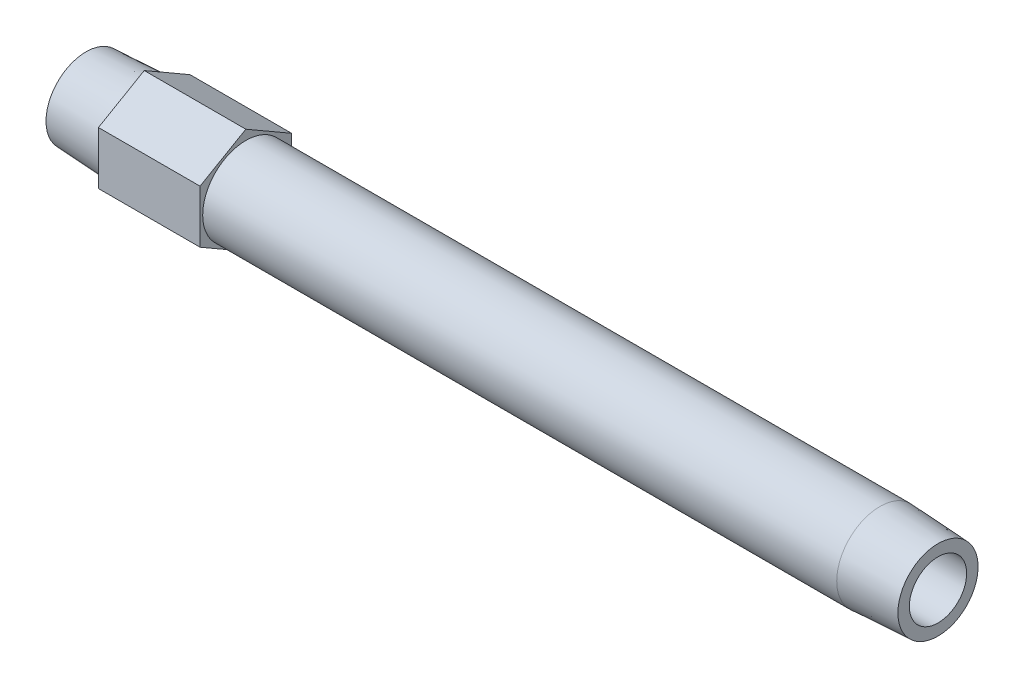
ISO-10303-21;
HEADER;
FILE_DESCRIPTION(('STEP AP214'),'2;1');
FILE_NAME('part.step','',(''),(''),'','','');
FILE_SCHEMA(('AUTOMOTIVE_DESIGN { 1 0 10303 214 1 1 1 1 }'));
ENDSEC;
DATA;
#1=APPLICATION_CONTEXT('core data for automotive mechanical design processes');
#2=APPLICATION_PROTOCOL_DEFINITION('international standard','automotive_design',2000,#1);
#3=PRODUCT_CONTEXT('',#1,'mechanical');
#4=PRODUCT('Part','Part','',(#3));
#5=PRODUCT_RELATED_PRODUCT_CATEGORY('part','',(#4));
#6=PRODUCT_DEFINITION_FORMATION('','',#4);
#7=PRODUCT_DEFINITION_CONTEXT('part definition',#1,'design');
#8=PRODUCT_DEFINITION('design','',#6,#7);
#9=PRODUCT_DEFINITION_SHAPE('','',#8);
#10=(LENGTH_UNIT() NAMED_UNIT(*) SI_UNIT(.MILLI.,.METRE.));
#11=(NAMED_UNIT(*) PLANE_ANGLE_UNIT() SI_UNIT($,.RADIAN.));
#12=(NAMED_UNIT(*) SI_UNIT($,.STERADIAN.) SOLID_ANGLE_UNIT());
#13=UNCERTAINTY_MEASURE_WITH_UNIT(LENGTH_MEASURE(1.E-05),#10,'distance_accuracy_value','');
#14=(GEOMETRIC_REPRESENTATION_CONTEXT(3) GLOBAL_UNCERTAINTY_ASSIGNED_CONTEXT((#13)) GLOBAL_UNIT_ASSIGNED_CONTEXT((#10,
#11,#12)) REPRESENTATION_CONTEXT('',''));
#15=CARTESIAN_POINT('',(0.,0.,0.));
#16=DIRECTION('',(0.,0.,1.));
#17=DIRECTION('',(1.,0.,0.));
#18=AXIS2_PLACEMENT_3D('',#15,#16,#17);
#19=CARTESIAN_POINT('',(0.,0.,-4.78009397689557));
#20=DIRECTION('',(1.,0.,0.));
#21=DIRECTION('',(0.,0.,-1.));
#22=AXIS2_PLACEMENT_3D('',#19,#20,#21);
#23=PLANE('',#22);
#24=CARTESIAN_POINT('',(0.,0.,0.));
#25=DIRECTION('',(-1.,0.,0.));
#26=DIRECTION('',(0.,0.,1.));
#27=AXIS2_PLACEMENT_3D('',#24,#25,#26);
#28=CIRCLE('',#27,4.78009397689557);
#29=CARTESIAN_POINT('',(0.,0.,4.78009397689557));
#30=VERTEX_POINT('',#29);
#31=EDGE_CURVE('E147',#30,#30,#28,.T.);
#32=ORIENTED_EDGE('',*,*,#31,.T.);
#33=EDGE_LOOP('',(#32));
#34=FACE_BOUND('',#33,.T.);
#35=CARTESIAN_POINT('',(0.,0.,0.));
#36=DIRECTION('',(1.,0.,0.));
#37=DIRECTION('',(0.,0.,1.));
#38=AXIS2_PLACEMENT_3D('',#35,#36,#37);
#39=CIRCLE('',#38,3.4163);
#40=CARTESIAN_POINT('',(0.,0.,3.4163));
#41=VERTEX_POINT('',#40);
#42=EDGE_CURVE('E159',#41,#41,#39,.T.);
#43=ORIENTED_EDGE('',*,*,#42,.T.);
#44=EDGE_LOOP('',(#43));
#45=FACE_BOUND('',#44,.T.);
#46=ADVANCED_FACE('F15',(#34,#45),#23,.F.);
#47=CARTESIAN_POINT('',(101.6,0.,-4.78009397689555));
#48=DIRECTION('',(-1.,0.,0.));
#49=DIRECTION('',(0.,0.,1.));
#50=AXIS2_PLACEMENT_3D('',#47,#48,#49);
#51=PLANE('',#50);
#52=CARTESIAN_POINT('',(101.6,0.,0.));
#53=DIRECTION('',(-1.,0.,0.));
#54=DIRECTION('',(0.,0.,1.));
#55=AXIS2_PLACEMENT_3D('',#52,#53,#54);
#56=CIRCLE('',#55,4.78009397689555);
#57=CARTESIAN_POINT('',(101.6,0.,4.78009397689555));
#58=VERTEX_POINT('',#57);
#59=EDGE_CURVE('E150',#58,#58,#56,.T.);
#60=ORIENTED_EDGE('',*,*,#59,.F.);
#61=EDGE_LOOP('',(#60));
#62=FACE_BOUND('',#61,.T.);
#63=CARTESIAN_POINT('',(101.6,0.,0.));
#64=DIRECTION('',(-1.,0.,0.));
#65=DIRECTION('',(0.,0.,1.));
#66=AXIS2_PLACEMENT_3D('',#63,#64,#65);
#67=CIRCLE('',#66,3.4163);
#68=CARTESIAN_POINT('',(101.6,0.,3.4163));
#69=VERTEX_POINT('',#68);
#70=EDGE_CURVE('E156',#69,#69,#67,.F.);
#71=ORIENTED_EDGE('',*,*,#70,.F.);
#72=EDGE_LOOP('',(#71));
#73=FACE_BOUND('',#72,.T.);
#74=ADVANCED_FACE('F178',(#62,#73),#51,.F.);
#75=CARTESIAN_POINT('',(19.05,-9.45872946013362,5.461));
#76=DIRECTION('',(-1.,0.,0.));
#77=DIRECTION('',(0.,-1.,0.));
#78=AXIS2_PLACEMENT_3D('',#75,#76,#77);
#79=PLANE('',#78);
#80=DIRECTION('',(0.,0.5,-0.866025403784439));
#81=VECTOR('',#80,1.);
#82=CARTESIAN_POINT('',(19.05,-6.30581964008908,0.));
#83=LINE('',#82,#81);
#84=CARTESIAN_POINT('',(19.05,-6.30581964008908,0.));
#85=VERTEX_POINT('',#84);
#86=CARTESIAN_POINT('',(19.05,-3.15290982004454,-5.461));
#87=VERTEX_POINT('',#86);
#88=EDGE_CURVE('E103',#85,#87,#83,.T.);
#89=ORIENTED_EDGE('',*,*,#88,.T.);
#90=DIRECTION('',(0.,1.,0.));
#91=VECTOR('',#90,1.);
#92=CARTESIAN_POINT('',(19.05,-3.15290982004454,-5.461));
#93=LINE('',#92,#91);
#94=CARTESIAN_POINT('',(19.05,3.15290982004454,-5.461));
#95=VERTEX_POINT('',#94);
#96=EDGE_CURVE('E83',#87,#95,#93,.T.);
#97=ORIENTED_EDGE('',*,*,#96,.T.);
#98=DIRECTION('',(0.,0.5,0.866025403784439));
#99=VECTOR('',#98,1.);
#100=CARTESIAN_POINT('',(19.05,3.15290982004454,-5.461));
#101=LINE('',#100,#99);
#102=CARTESIAN_POINT('',(19.05,6.30581964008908,0.));
#103=VERTEX_POINT('',#102);
#104=EDGE_CURVE('E102',#95,#103,#101,.T.);
#105=ORIENTED_EDGE('',*,*,#104,.T.);
#106=DIRECTION('',(0.,-0.5,0.866025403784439));
#107=VECTOR('',#106,1.);
#108=CARTESIAN_POINT('',(19.05,6.30581964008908,0.));
#109=LINE('',#108,#107);
#110=CARTESIAN_POINT('',(19.05,3.15290982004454,5.461));
#111=VERTEX_POINT('',#110);
#112=EDGE_CURVE('E105',#103,#111,#109,.T.);
#113=ORIENTED_EDGE('',*,*,#112,.T.);
#114=DIRECTION('',(0.,-1.,0.));
#115=VECTOR('',#114,1.);
#116=CARTESIAN_POINT('',(19.05,3.15290982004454,5.461));
#117=LINE('',#116,#115);
#118=CARTESIAN_POINT('',(19.05,-3.15290982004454,5.461));
#119=VERTEX_POINT('',#118);
#120=EDGE_CURVE('E35',#111,#119,#117,.T.);
#121=ORIENTED_EDGE('',*,*,#120,.T.);
#122=DIRECTION('',(0.,-0.5,-0.866025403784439));
#123=VECTOR('',#122,1.);
#124=CARTESIAN_POINT('',(19.05,-3.15290982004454,5.461));
#125=LINE('',#124,#123);
#126=EDGE_CURVE('E30',#119,#85,#125,.T.);
#127=ORIENTED_EDGE('',*,*,#126,.T.);
#128=EDGE_LOOP('',(#89,#97,#105,#113,#121,#127));
#129=FACE_BOUND('',#128,.T.);
#130=CARTESIAN_POINT('',(19.05,0.,0.));
#131=DIRECTION('',(-1.,0.,0.));
#132=DIRECTION('',(0.,-1.,0.));
#133=AXIS2_PLACEMENT_3D('',#130,#131,#132);
#134=CIRCLE('',#133,5.1435);
#135=CARTESIAN_POINT('',(19.05,-5.1435,0.));
#136=VERTEX_POINT('',#135);
#137=EDGE_CURVE('E89',#136,#136,#134,.F.);
#138=ORIENTED_EDGE('',*,*,#137,.F.);
#139=EDGE_LOOP('',(#138));
#140=FACE_BOUND('',#139,.T.);
#141=ADVANCED_FACE('F124',(#129,#140),#79,.F.);
#142=CARTESIAN_POINT('',(6.9342,-9.45872946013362,5.461));
#143=DIRECTION('',(-1.,0.,0.));
#144=DIRECTION('',(0.,-1.,0.));
#145=AXIS2_PLACEMENT_3D('',#142,#143,#144);
#146=PLANE('',#145);
#147=DIRECTION('',(0.,0.5,-0.866025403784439));
#148=VECTOR('',#147,1.);
#149=CARTESIAN_POINT('',(6.9342,-6.30581964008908,0.));
#150=LINE('',#149,#148);
#151=CARTESIAN_POINT('',(6.9342,-6.30581964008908,0.));
#152=VERTEX_POINT('',#151);
#153=CARTESIAN_POINT('',(6.9342,-3.15290982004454,-5.461));
#154=VERTEX_POINT('',#153);
#155=EDGE_CURVE('E73',#152,#154,#150,.T.);
#156=ORIENTED_EDGE('',*,*,#155,.F.);
#157=DIRECTION('',(0.,-0.5,-0.866025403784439));
#158=VECTOR('',#157,1.);
#159=CARTESIAN_POINT('',(6.9342,-3.15290982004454,5.461));
#160=LINE('',#159,#158);
#161=CARTESIAN_POINT('',(6.9342,-3.15290982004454,5.461));
#162=VERTEX_POINT('',#161);
#163=EDGE_CURVE('E99',#162,#152,#160,.T.);
#164=ORIENTED_EDGE('',*,*,#163,.F.);
#165=DIRECTION('',(0.,-1.,0.));
#166=VECTOR('',#165,1.);
#167=CARTESIAN_POINT('',(6.9342,3.15290982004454,5.461));
#168=LINE('',#167,#166);
#169=CARTESIAN_POINT('',(6.9342,3.15290982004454,5.461));
#170=VERTEX_POINT('',#169);
#171=EDGE_CURVE('E133',#170,#162,#168,.T.);
#172=ORIENTED_EDGE('',*,*,#171,.F.);
#173=DIRECTION('',(0.,-0.5,0.866025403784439));
#174=VECTOR('',#173,1.);
#175=CARTESIAN_POINT('',(6.9342,6.30581964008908,0.));
#176=LINE('',#175,#174);
#177=CARTESIAN_POINT('',(6.9342,6.30581964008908,0.));
#178=VERTEX_POINT('',#177);
#179=EDGE_CURVE('E129',#178,#170,#176,.T.);
#180=ORIENTED_EDGE('',*,*,#179,.F.);
#181=DIRECTION('',(0.,0.5,0.866025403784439));
#182=VECTOR('',#181,1.);
#183=CARTESIAN_POINT('',(6.9342,3.15290982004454,-5.461));
#184=LINE('',#183,#182);
#185=CARTESIAN_POINT('',(6.9342,3.15290982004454,-5.461));
#186=VERTEX_POINT('',#185);
#187=EDGE_CURVE('E75',#186,#178,#184,.T.);
#188=ORIENTED_EDGE('',*,*,#187,.F.);
#189=DIRECTION('',(0.,1.,0.));
#190=VECTOR('',#189,1.);
#191=CARTESIAN_POINT('',(6.9342,-3.15290982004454,-5.461));
#192=LINE('',#191,#190);
#193=EDGE_CURVE('E68',#154,#186,#192,.T.);
#194=ORIENTED_EDGE('',*,*,#193,.F.);
#195=EDGE_LOOP('',(#156,#164,#172,#180,#188,#194));
#196=FACE_BOUND('',#195,.T.);
#197=CARTESIAN_POINT('',(6.9342,0.,0.));
#198=DIRECTION('',(-1.,0.,0.));
#199=DIRECTION('',(0.,0.,1.));
#200=AXIS2_PLACEMENT_3D('',#197,#198,#199);
#201=CIRCLE('',#200,5.1435);
#202=CARTESIAN_POINT('',(6.9342,0.,5.1435));
#203=VERTEX_POINT('',#202);
#204=EDGE_CURVE('E95',#203,#203,#201,.T.);
#205=ORIENTED_EDGE('',*,*,#204,.F.);
#206=EDGE_LOOP('',(#205));
#207=FACE_BOUND('',#206,.T.);
#208=ADVANCED_FACE('F69',(#196,#207),#146,.T.);
#209=CARTESIAN_POINT('',(19.05,-6.30581964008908,0.));
#210=DIRECTION('',(0.,0.866025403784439,0.5));
#211=DIRECTION('',(0.,-0.5,0.866025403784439));
#212=AXIS2_PLACEMENT_3D('',#209,#210,#211);
#213=PLANE('',#212);
#214=ORIENTED_EDGE('',*,*,#155,.T.);
#215=DIRECTION('',(-1.,0.,0.));
#216=VECTOR('',#215,1.);
#217=CARTESIAN_POINT('',(19.05,-3.15290982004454,-5.461));
#218=LINE('',#217,#216);
#219=EDGE_CURVE('E10',#87,#154,#218,.T.);
#220=ORIENTED_EDGE('',*,*,#219,.F.);
#221=ORIENTED_EDGE('',*,*,#88,.F.);
#222=DIRECTION('',(-1.,0.,0.));
#223=VECTOR('',#222,1.);
#224=CARTESIAN_POINT('',(19.05,-6.30581964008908,0.));
#225=LINE('',#224,#223);
#226=EDGE_CURVE('E87',#85,#152,#225,.T.);
#227=ORIENTED_EDGE('',*,*,#226,.T.);
#228=EDGE_LOOP('',(#214,#220,#221,#227));
#229=FACE_BOUND('',#228,.T.);
#230=ADVANCED_FACE('F17',(#229),#213,.F.);
#231=CARTESIAN_POINT('',(19.05,-3.15290982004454,-5.461));
#232=DIRECTION('',(0.,0.,1.));
#233=DIRECTION('',(0.,-1.,0.));
#234=AXIS2_PLACEMENT_3D('',#231,#232,#233);
#235=PLANE('',#234);
#236=ORIENTED_EDGE('',*,*,#193,.T.);
#237=DIRECTION('',(-1.,0.,0.));
#238=VECTOR('',#237,1.);
#239=CARTESIAN_POINT('',(19.05,3.15290982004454,-5.461));
#240=LINE('',#239,#238);
#241=EDGE_CURVE('E23',#95,#186,#240,.T.);
#242=ORIENTED_EDGE('',*,*,#241,.F.);
#243=ORIENTED_EDGE('',*,*,#96,.F.);
#244=ORIENTED_EDGE('',*,*,#219,.T.);
#245=EDGE_LOOP('',(#236,#242,#243,#244));
#246=FACE_BOUND('',#245,.T.);
#247=ADVANCED_FACE('F82',(#246),#235,.F.);
#248=CARTESIAN_POINT('',(19.05,3.15290982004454,-5.461));
#249=DIRECTION('',(0.,-0.866025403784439,0.5));
#250=DIRECTION('',(0.,-0.5,-0.866025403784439));
#251=AXIS2_PLACEMENT_3D('',#248,#249,#250);
#252=PLANE('',#251);
#253=ORIENTED_EDGE('',*,*,#187,.T.);
#254=DIRECTION('',(-1.,0.,0.));
#255=VECTOR('',#254,1.);
#256=CARTESIAN_POINT('',(19.05,6.30581964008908,0.));
#257=LINE('',#256,#255);
#258=EDGE_CURVE('E117',#103,#178,#257,.T.);
#259=ORIENTED_EDGE('',*,*,#258,.F.);
#260=ORIENTED_EDGE('',*,*,#104,.F.);
#261=ORIENTED_EDGE('',*,*,#241,.T.);
#262=EDGE_LOOP('',(#253,#259,#260,#261));
#263=FACE_BOUND('',#262,.T.);
#264=ADVANCED_FACE('F121',(#263),#252,.F.);
#265=CARTESIAN_POINT('',(19.05,6.30581964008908,0.));
#266=DIRECTION('',(0.,-0.866025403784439,-0.5));
#267=DIRECTION('',(0.,0.5,-0.866025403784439));
#268=AXIS2_PLACEMENT_3D('',#265,#266,#267);
#269=PLANE('',#268);
#270=ORIENTED_EDGE('',*,*,#179,.T.);
#271=DIRECTION('',(-1.,0.,0.));
#272=VECTOR('',#271,1.);
#273=CARTESIAN_POINT('',(19.05,3.15290982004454,5.461));
#274=LINE('',#273,#272);
#275=EDGE_CURVE('E114',#111,#170,#274,.T.);
#276=ORIENTED_EDGE('',*,*,#275,.F.);
#277=ORIENTED_EDGE('',*,*,#112,.F.);
#278=ORIENTED_EDGE('',*,*,#258,.T.);
#279=EDGE_LOOP('',(#270,#276,#277,#278));
#280=FACE_BOUND('',#279,.T.);
#281=ADVANCED_FACE('F128',(#280),#269,.F.);
#282=CARTESIAN_POINT('',(19.05,3.15290982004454,5.461));
#283=DIRECTION('',(0.,0.,-1.));
#284=DIRECTION('',(-1.,0.,0.));
#285=AXIS2_PLACEMENT_3D('',#282,#283,#284);
#286=PLANE('',#285);
#287=ORIENTED_EDGE('',*,*,#171,.T.);
#288=DIRECTION('',(-1.,0.,0.));
#289=VECTOR('',#288,1.);
#290=CARTESIAN_POINT('',(19.05,-3.15290982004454,5.461));
#291=LINE('',#290,#289);
#292=EDGE_CURVE('E111',#119,#162,#291,.T.);
#293=ORIENTED_EDGE('',*,*,#292,.F.);
#294=ORIENTED_EDGE('',*,*,#120,.F.);
#295=ORIENTED_EDGE('',*,*,#275,.T.);
#296=EDGE_LOOP('',(#287,#293,#294,#295));
#297=FACE_BOUND('',#296,.T.);
#298=ADVANCED_FACE('F132',(#297),#286,.F.);
#299=CARTESIAN_POINT('',(19.05,-3.15290982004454,5.461));
#300=DIRECTION('',(0.,0.866025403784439,-0.5));
#301=DIRECTION('',(0.,0.5,0.866025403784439));
#302=AXIS2_PLACEMENT_3D('',#299,#300,#301);
#303=PLANE('',#302);
#304=ORIENTED_EDGE('',*,*,#163,.T.);
#305=ORIENTED_EDGE('',*,*,#226,.F.);
#306=ORIENTED_EDGE('',*,*,#126,.F.);
#307=ORIENTED_EDGE('',*,*,#292,.T.);
#308=EDGE_LOOP('',(#304,#305,#306,#307));
#309=FACE_BOUND('',#308,.T.);
#310=ADVANCED_FACE('F135',(#309),#303,.F.);
#311=CARTESIAN_POINT('',(6.9342,0.,0.));
#312=DIRECTION('',(1.,0.,0.));
#313=DIRECTION('',(0.,0.,-1.));
#314=AXIS2_PLACEMENT_3D('',#311,#312,#313);
#315=CONICAL_SURFACE('',#314,5.1435,0.0523598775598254);
#316=ORIENTED_EDGE('',*,*,#31,.F.);
#317=EDGE_LOOP('',(#316));
#318=FACE_BOUND('',#317,.T.);
#319=ORIENTED_EDGE('',*,*,#204,.T.);
#320=EDGE_LOOP('',(#319));
#321=FACE_BOUND('',#320,.T.);
#322=ADVANCED_FACE('F187',(#318,#321),#315,.T.);
#323=CARTESIAN_POINT('',(-60.,0.,0.));
#324=DIRECTION('',(-1.,0.,0.));
#325=DIRECTION('',(0.,0.,1.));
#326=AXIS2_PLACEMENT_3D('',#323,#324,#325);
#327=CYLINDRICAL_SURFACE('',#326,5.1435);
#328=ORIENTED_EDGE('',*,*,#137,.T.);
#329=EDGE_LOOP('',(#328));
#330=FACE_BOUND('',#329,.T.);
#331=CARTESIAN_POINT('',(94.6658,0.,0.));
#332=DIRECTION('',(-1.,0.,0.));
#333=DIRECTION('',(0.,0.,1.));
#334=AXIS2_PLACEMENT_3D('',#331,#332,#333);
#335=CIRCLE('',#334,5.1435);
#336=CARTESIAN_POINT('',(94.6658,0.,5.1435));
#337=VERTEX_POINT('',#336);
#338=EDGE_CURVE('E153',#337,#337,#335,.T.);
#339=ORIENTED_EDGE('',*,*,#338,.T.);
#340=EDGE_LOOP('',(#339));
#341=FACE_BOUND('',#340,.T.);
#342=ADVANCED_FACE('F174',(#330,#341),#327,.T.);
#343=CARTESIAN_POINT('',(101.6,0.,0.));
#344=DIRECTION('',(-1.,0.,0.));
#345=DIRECTION('',(0.,0.,1.));
#346=AXIS2_PLACEMENT_3D('',#343,#344,#345);
#347=CONICAL_SURFACE('',#346,4.78009397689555,0.0523598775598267);
#348=ORIENTED_EDGE('',*,*,#338,.F.);
#349=EDGE_LOOP('',(#348));
#350=FACE_BOUND('',#349,.T.);
#351=ORIENTED_EDGE('',*,*,#59,.T.);
#352=EDGE_LOOP('',(#351));
#353=FACE_BOUND('',#352,.T.);
#354=ADVANCED_FACE('F167',(#350,#353),#347,.T.);
#355=CARTESIAN_POINT('',(102.960689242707,0.,0.));
#356=DIRECTION('',(-1.,0.,0.));
#357=DIRECTION('',(0.,0.,1.));
#358=AXIS2_PLACEMENT_3D('',#355,#356,#357);
#359=CYLINDRICAL_SURFACE('',#358,3.4163);
#360=ORIENTED_EDGE('',*,*,#70,.T.);
#361=EDGE_LOOP('',(#360));
#362=FACE_BOUND('',#361,.T.);
#363=ORIENTED_EDGE('',*,*,#42,.F.);
#364=EDGE_LOOP('',(#363));
#365=FACE_BOUND('',#364,.T.);
#366=ADVANCED_FACE('F165',(#362,#365),#359,.F.);
#367=CLOSED_SHELL('',(#46,#74,#141,#208,#230,#247,#264,#281,#298,#310,#322,#342,#354,#366));
#368=MANIFOLD_SOLID_BREP('B1',#367);
#369=ADVANCED_BREP_SHAPE_REPRESENTATION('',(#18,#368),#14);
#370=SHAPE_DEFINITION_REPRESENTATION(#9,#369);
ENDSEC;
END-ISO-10303-21;
